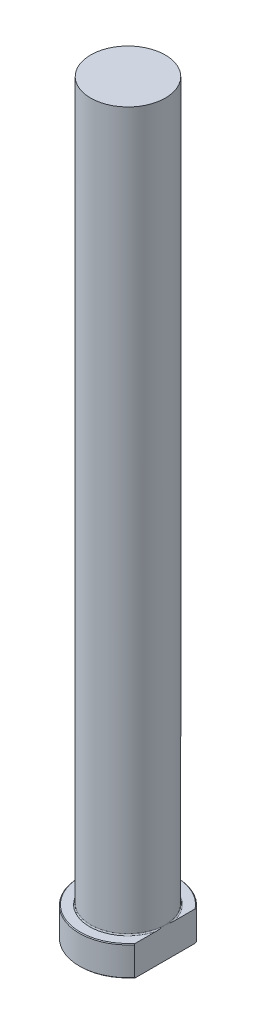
from build123d import *
from build123d.topology import SkipClean

# Parameters (mm, degrees)
CHAMFER1_SIZE = 0.2
FILLET1_R     = 0.3
KEY_DEPTH     = 201.84322244


with BuildPart() as part:
    # Sketch1 → Revolve1 (revolve)
    with BuildSketch(Plane.XY, mode=Mode.PRIVATE) as revolve1_sk:
        Polygon((0, 0), (-13, 0), (-13, 8), (-10, 8), (-10, 200), (0, 200), align=None)
    revolve(revolve1_sk.sketch.rotate(Axis((0, 259.958771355, 0), (0, -1, 0)), 270), axis=Axis((0, 259.958771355, 0), (0, -1, 0)))

    # Chamfer1
    chamfer1_edges = [part.edges().sort_by_distance(p)[0] for p in [
        (0, 8, -13),
        (0, 0, -13),
    ]]
    chamfer(chamfer1_edges, length=CHAMFER1_SIZE)

    # Fillet1
    fillet1_edges = [part.edges().sort_by_distance(p)[0] for p in [
        (0, 8, -10),
    ]]
    fillet(fillet1_edges, radius=FILLET1_R)

    # Sketch2 → KEY (cut, through all)
    with SkipClean():  # the faces are left unmerged after this step: merging them gives an invalid solid
        with BuildSketch(Plane(origin=(0, 0, 0), x_dir=(1, 0, 0), z_dir=(0, 1, 0))):
            with BuildLine():
                Line((10, 8.306623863), (10, -8.306623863))
                ThreePointArc((10, -8.306623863), (13, 0), (10, 8.306623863))
            make_face()
        extrude(amount=KEY_DEPTH, mode=Mode.SUBTRACT)


solid = part.part
